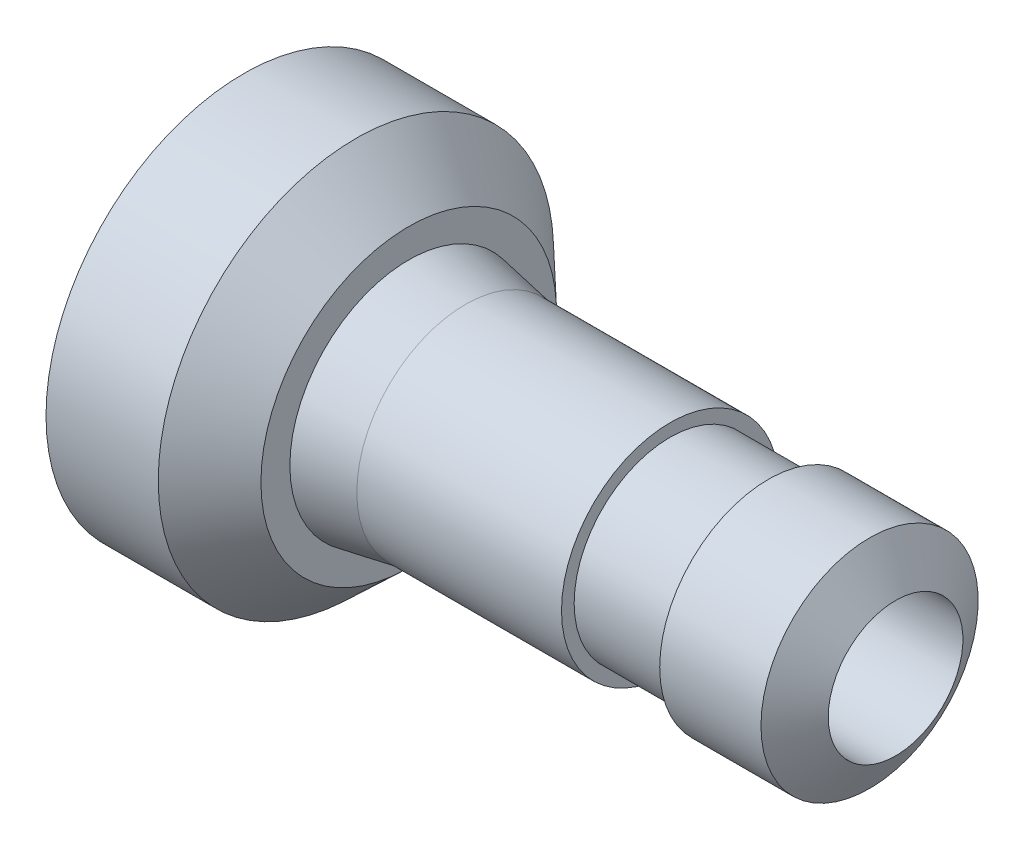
ISO-10303-21;
HEADER;
FILE_DESCRIPTION(('STEP AP214'),'2;1');
FILE_NAME('part.step','',(''),(''),'','','');
FILE_SCHEMA(('AUTOMOTIVE_DESIGN { 1 0 10303 214 1 1 1 1 }'));
ENDSEC;
DATA;
#1=APPLICATION_CONTEXT('core data for automotive mechanical design processes');
#2=APPLICATION_PROTOCOL_DEFINITION('international standard','automotive_design',2000,#1);
#3=PRODUCT_CONTEXT('',#1,'mechanical');
#4=PRODUCT('Part','Part','',(#3));
#5=PRODUCT_RELATED_PRODUCT_CATEGORY('part','',(#4));
#6=PRODUCT_DEFINITION_FORMATION('','',#4);
#7=PRODUCT_DEFINITION_CONTEXT('part definition',#1,'design');
#8=PRODUCT_DEFINITION('design','',#6,#7);
#9=PRODUCT_DEFINITION_SHAPE('','',#8);
#10=(LENGTH_UNIT() NAMED_UNIT(*) SI_UNIT(.MILLI.,.METRE.));
#11=(NAMED_UNIT(*) PLANE_ANGLE_UNIT() SI_UNIT($,.RADIAN.));
#12=(NAMED_UNIT(*) SI_UNIT($,.STERADIAN.) SOLID_ANGLE_UNIT());
#13=UNCERTAINTY_MEASURE_WITH_UNIT(LENGTH_MEASURE(1.E-05),#10,'distance_accuracy_value','');
#14=(GEOMETRIC_REPRESENTATION_CONTEXT(3) GLOBAL_UNCERTAINTY_ASSIGNED_CONTEXT((#13)) GLOBAL_UNIT_ASSIGNED_CONTEXT((#10,
#11,#12)) REPRESENTATION_CONTEXT('',''));
#15=CARTESIAN_POINT('',(0.,0.,0.));
#16=DIRECTION('',(0.,0.,1.));
#17=DIRECTION('',(1.,0.,0.));
#18=AXIS2_PLACEMENT_3D('',#15,#16,#17);
#19=CARTESIAN_POINT('',(234.50123622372,0.,0.));
#20=DIRECTION('',(-1.,0.,0.));
#21=DIRECTION('',(0.,0.,1.));
#22=AXIS2_PLACEMENT_3D('',#19,#20,#21);
#23=CONICAL_SURFACE('',#22,24.2189825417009,1.0085967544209);
#24=CARTESIAN_POINT('',(225.147772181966,0.,0.));
#25=DIRECTION('',(-1.,0.,0.));
#26=DIRECTION('',(0.,0.,1.));
#27=AXIS2_PLACEMENT_3D('',#24,#25,#26);
#28=CIRCLE('',#27,39.0653285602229);
#29=CARTESIAN_POINT('',(225.147772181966,0.,39.0653285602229));
#30=VERTEX_POINT('',#29);
#31=EDGE_CURVE('E10',#30,#30,#28,.T.);
#32=ORIENTED_EDGE('',*,*,#31,.F.);
#33=EDGE_LOOP('',(#32));
#34=FACE_BOUND('',#33,.T.);
#35=CARTESIAN_POINT('',(234.50123622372,0.,0.));
#36=DIRECTION('',(-1.,0.,0.));
#37=DIRECTION('',(0.,0.,1.));
#38=AXIS2_PLACEMENT_3D('',#35,#36,#37);
#39=CIRCLE('',#38,24.2189825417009);
#40=CARTESIAN_POINT('',(234.50123622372,0.,24.2189825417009));
#41=VERTEX_POINT('',#40);
#42=EDGE_CURVE('E77',#41,#41,#39,.T.);
#43=ORIENTED_EDGE('',*,*,#42,.T.);
#44=EDGE_LOOP('',(#43));
#45=FACE_BOUND('',#44,.T.);
#46=ADVANCED_FACE('F37',(#34,#45),#23,.T.);
#47=CARTESIAN_POINT('',(0.,0.,0.));
#48=DIRECTION('',(-1.,0.,0.));
#49=DIRECTION('',(0.,0.,1.));
#50=AXIS2_PLACEMENT_3D('',#47,#48,#49);
#51=CYLINDRICAL_SURFACE('',#50,39.0653285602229);
#52=CARTESIAN_POINT('',(188.724473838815,0.,0.));
#53=DIRECTION('',(-1.,0.,0.));
#54=DIRECTION('',(0.,0.,1.));
#55=AXIS2_PLACEMENT_3D('',#52,#53,#54);
#56=CIRCLE('',#55,39.0653285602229);
#57=CARTESIAN_POINT('',(188.724473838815,0.,39.0653285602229));
#58=VERTEX_POINT('',#57);
#59=EDGE_CURVE('E44',#58,#58,#56,.T.);
#60=ORIENTED_EDGE('',*,*,#59,.F.);
#61=EDGE_LOOP('',(#60));
#62=FACE_BOUND('',#61,.T.);
#63=ORIENTED_EDGE('',*,*,#31,.T.);
#64=EDGE_LOOP('',(#63));
#65=FACE_BOUND('',#64,.T.);
#66=ADVANCED_FACE('F97',(#62,#65),#51,.T.);
#67=CARTESIAN_POINT('',(188.724473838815,34.5153330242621,0.));
#68=DIRECTION('',(1.,0.,0.));
#69=DIRECTION('',(0.,0.,-1.));
#70=AXIS2_PLACEMENT_3D('',#67,#68,#69);
#71=PLANE('',#70);
#72=CARTESIAN_POINT('',(188.724473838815,0.,0.));
#73=DIRECTION('',(-1.,0.,0.));
#74=DIRECTION('',(0.,0.,1.));
#75=AXIS2_PLACEMENT_3D('',#72,#73,#74);
#76=CIRCLE('',#75,34.5153330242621);
#77=CARTESIAN_POINT('',(188.724473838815,0.,34.5153330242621));
#78=VERTEX_POINT('',#77);
#79=EDGE_CURVE('E48',#78,#78,#76,.T.);
#80=ORIENTED_EDGE('',*,*,#79,.F.);
#81=EDGE_LOOP('',(#80));
#82=FACE_BOUND('',#81,.T.);
#83=ORIENTED_EDGE('',*,*,#59,.T.);
#84=EDGE_LOOP('',(#83));
#85=FACE_BOUND('',#84,.T.);
#86=ADVANCED_FACE('F102',(#82,#85),#71,.F.);
#87=CARTESIAN_POINT('',(0.,0.,0.));
#88=DIRECTION('',(-1.,0.,0.));
#89=DIRECTION('',(0.,0.,1.));
#90=AXIS2_PLACEMENT_3D('',#87,#88,#89);
#91=CYLINDRICAL_SURFACE('',#90,34.5153330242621);
#92=CARTESIAN_POINT('',(153.394127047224,0.,0.));
#93=DIRECTION('',(-1.,0.,0.));
#94=DIRECTION('',(0.,0.,1.));
#95=AXIS2_PLACEMENT_3D('',#92,#93,#94);
#96=CIRCLE('',#95,34.5153330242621);
#97=CARTESIAN_POINT('',(153.394127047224,0.,34.5153330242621));
#98=VERTEX_POINT('',#97);
#99=EDGE_CURVE('E53',#98,#98,#96,.T.);
#100=ORIENTED_EDGE('',*,*,#99,.F.);
#101=EDGE_LOOP('',(#100));
#102=FACE_BOUND('',#101,.T.);
#103=ORIENTED_EDGE('',*,*,#79,.T.);
#104=EDGE_LOOP('',(#103));
#105=FACE_BOUND('',#104,.T.);
#106=ADVANCED_FACE('F107',(#102,#105),#91,.T.);
#107=CARTESIAN_POINT('',(153.394127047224,39.0653285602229,0.));
#108=DIRECTION('',(-1.,0.,0.));
#109=DIRECTION('',(0.,0.,1.));
#110=AXIS2_PLACEMENT_3D('',#107,#108,#109);
#111=PLANE('',#110);
#112=CARTESIAN_POINT('',(153.394127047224,0.,0.));
#113=DIRECTION('',(-1.,0.,0.));
#114=DIRECTION('',(0.,0.,1.));
#115=AXIS2_PLACEMENT_3D('',#112,#113,#114);
#116=CIRCLE('',#115,39.0653285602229);
#117=CARTESIAN_POINT('',(153.394127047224,0.,39.0653285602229));
#118=VERTEX_POINT('',#117);
#119=EDGE_CURVE('E56',#118,#118,#116,.T.);
#120=ORIENTED_EDGE('',*,*,#119,.F.);
#121=EDGE_LOOP('',(#120));
#122=FACE_BOUND('',#121,.T.);
#123=ORIENTED_EDGE('',*,*,#99,.T.);
#124=EDGE_LOOP('',(#123));
#125=FACE_BOUND('',#124,.T.);
#126=ADVANCED_FACE('F114',(#122,#125),#111,.F.);
#127=CARTESIAN_POINT('',(0.,0.,0.));
#128=DIRECTION('',(-1.,0.,0.));
#129=DIRECTION('',(0.,0.,1.));
#130=AXIS2_PLACEMENT_3D('',#127,#128,#129);
#131=CYLINDRICAL_SURFACE('',#130,39.0653285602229);
#132=CARTESIAN_POINT('',(79.7563770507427,0.,0.));
#133=DIRECTION('',(-1.,0.,0.));
#134=DIRECTION('',(0.,0.,1.));
#135=AXIS2_PLACEMENT_3D('',#132,#133,#134);
#136=CIRCLE('',#135,39.0653285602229);
#137=CARTESIAN_POINT('',(79.7563770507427,0.,39.0653285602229));
#138=VERTEX_POINT('',#137);
#139=EDGE_CURVE('E59',#138,#138,#136,.T.);
#140=ORIENTED_EDGE('',*,*,#139,.F.);
#141=EDGE_LOOP('',(#140));
#142=FACE_BOUND('',#141,.T.);
#143=ORIENTED_EDGE('',*,*,#119,.T.);
#144=EDGE_LOOP('',(#143));
#145=FACE_BOUND('',#144,.T.);
#146=ADVANCED_FACE('F118',(#142,#145),#131,.T.);
#147=CARTESIAN_POINT('',(79.7563770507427,0.,0.));
#148=DIRECTION('',(-1.,0.,0.));
#149=DIRECTION('',(0.,0.,1.));
#150=AXIS2_PLACEMENT_3D('',#147,#148,#149);
#151=CONICAL_SURFACE('',#150,39.0653285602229,0.178494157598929);
#152=CARTESIAN_POINT('',(59.3664055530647,0.,0.));
#153=DIRECTION('',(-1.,0.,0.));
#154=DIRECTION('',(0.,0.,1.));
#155=AXIS2_PLACEMENT_3D('',#152,#153,#154);
#156=CIRCLE('',#155,42.7439699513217);
#157=CARTESIAN_POINT('',(59.3664055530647,0.,42.7439699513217));
#158=VERTEX_POINT('',#157);
#159=EDGE_CURVE('E62',#158,#158,#156,.T.);
#160=ORIENTED_EDGE('',*,*,#159,.F.);
#161=EDGE_LOOP('',(#160));
#162=FACE_BOUND('',#161,.T.);
#163=ORIENTED_EDGE('',*,*,#139,.T.);
#164=EDGE_LOOP('',(#163));
#165=FACE_BOUND('',#164,.T.);
#166=ADVANCED_FACE('F122',(#162,#165),#151,.T.);
#167=CARTESIAN_POINT('',(59.3664055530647,53.1537943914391,0.));
#168=DIRECTION('',(-1.,0.,0.));
#169=DIRECTION('',(0.,0.,1.));
#170=AXIS2_PLACEMENT_3D('',#167,#168,#169);
#171=PLANE('',#170);
#172=CARTESIAN_POINT('',(59.3664055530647,0.,0.));
#173=DIRECTION('',(-1.,0.,0.));
#174=DIRECTION('',(0.,0.,1.));
#175=AXIS2_PLACEMENT_3D('',#172,#173,#174);
#176=CIRCLE('',#175,53.1537943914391);
#177=CARTESIAN_POINT('',(59.3664055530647,0.,53.1537943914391));
#178=VERTEX_POINT('',#177);
#179=EDGE_CURVE('E65',#178,#178,#176,.T.);
#180=ORIENTED_EDGE('',*,*,#179,.F.);
#181=EDGE_LOOP('',(#180));
#182=FACE_BOUND('',#181,.T.);
#183=ORIENTED_EDGE('',*,*,#159,.T.);
#184=EDGE_LOOP('',(#183));
#185=FACE_BOUND('',#184,.T.);
#186=ADVANCED_FACE('F126',(#182,#185),#171,.F.);
#187=CARTESIAN_POINT('',(59.3664055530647,0.,0.));
#188=DIRECTION('',(-1.,0.,0.));
#189=DIRECTION('',(0.,0.,1.));
#190=AXIS2_PLACEMENT_3D('',#187,#188,#189);
#191=CONICAL_SURFACE('',#190,53.1537943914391,0.757368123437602);
#192=CARTESIAN_POINT('',(40.3829723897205,0.,0.));
#193=DIRECTION('',(-1.,0.,0.));
#194=DIRECTION('',(0.,0.,1.));
#195=AXIS2_PLACEMENT_3D('',#192,#193,#194);
#196=CIRCLE('',#195,71.1017675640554);
#197=CARTESIAN_POINT('',(40.3829723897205,0.,71.1017675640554));
#198=VERTEX_POINT('',#197);
#199=EDGE_CURVE('E68',#198,#198,#196,.T.);
#200=ORIENTED_EDGE('',*,*,#199,.F.);
#201=EDGE_LOOP('',(#200));
#202=FACE_BOUND('',#201,.T.);
#203=ORIENTED_EDGE('',*,*,#179,.T.);
#204=EDGE_LOOP('',(#203));
#205=FACE_BOUND('',#204,.T.);
#206=ADVANCED_FACE('F130',(#202,#205),#191,.T.);
#207=CARTESIAN_POINT('',(0.,0.,0.));
#208=DIRECTION('',(-1.,0.,0.));
#209=DIRECTION('',(0.,0.,1.));
#210=AXIS2_PLACEMENT_3D('',#207,#208,#209);
#211=CYLINDRICAL_SURFACE('',#210,71.1017675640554);
#212=CARTESIAN_POINT('',(0.,0.,0.));
#213=DIRECTION('',(-1.,0.,0.));
#214=DIRECTION('',(0.,0.,1.));
#215=AXIS2_PLACEMENT_3D('',#212,#213,#214);
#216=CIRCLE('',#215,71.1017675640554);
#217=CARTESIAN_POINT('',(0.,0.,71.1017675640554));
#218=VERTEX_POINT('',#217);
#219=EDGE_CURVE('E71',#218,#218,#216,.T.);
#220=ORIENTED_EDGE('',*,*,#219,.F.);
#221=EDGE_LOOP('',(#220));
#222=FACE_BOUND('',#221,.T.);
#223=ORIENTED_EDGE('',*,*,#199,.T.);
#224=EDGE_LOOP('',(#223));
#225=FACE_BOUND('',#224,.T.);
#226=ADVANCED_FACE('F134',(#222,#225),#211,.T.);
#227=CARTESIAN_POINT('',(0.,53.1536128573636,0.));
#228=DIRECTION('',(1.,0.,0.));
#229=DIRECTION('',(0.,0.,-1.));
#230=AXIS2_PLACEMENT_3D('',#227,#228,#229);
#231=PLANE('',#230);
#232=CARTESIAN_POINT('',(0.,0.,0.));
#233=DIRECTION('',(-1.,0.,0.));
#234=DIRECTION('',(0.,0.,1.));
#235=AXIS2_PLACEMENT_3D('',#232,#233,#234);
#236=CIRCLE('',#235,53.1536128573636);
#237=CARTESIAN_POINT('',(0.,0.,53.1536128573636));
#238=VERTEX_POINT('',#237);
#239=EDGE_CURVE('E74',#238,#238,#236,.T.);
#240=ORIENTED_EDGE('',*,*,#239,.F.);
#241=EDGE_LOOP('',(#240));
#242=FACE_BOUND('',#241,.T.);
#243=ORIENTED_EDGE('',*,*,#219,.T.);
#244=EDGE_LOOP('',(#243));
#245=FACE_BOUND('',#244,.T.);
#246=ADVANCED_FACE('F94',(#242,#245),#231,.F.);
#247=CARTESIAN_POINT('',(0.,0.,0.));
#248=DIRECTION('',(-1.,0.,0.));
#249=DIRECTION('',(0.,0.,1.));
#250=AXIS2_PLACEMENT_3D('',#247,#248,#249);
#251=TOROIDAL_SURFACE('',#250,34.5153330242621,18.6382798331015);
#252=CARTESIAN_POINT('',(15.5361076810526,0.,0.));
#253=DIRECTION('',(-1.,0.,0.));
#254=DIRECTION('',(0.,0.,1.));
#255=AXIS2_PLACEMENT_3D('',#252,#253,#254);
#256=CIRCLE('',#255,24.2189825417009);
#257=CARTESIAN_POINT('',(15.5361076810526,0.,24.2189825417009));
#258=VERTEX_POINT('',#257);
#259=EDGE_CURVE('E40',#258,#258,#256,.F.);
#260=ORIENTED_EDGE('',*,*,#259,.T.);
#261=EDGE_LOOP('',(#260));
#262=FACE_BOUND('',#261,.T.);
#263=ORIENTED_EDGE('',*,*,#239,.T.);
#264=EDGE_LOOP('',(#263));
#265=FACE_BOUND('',#264,.T.);
#266=ADVANCED_FACE('F84',(#262,#265),#251,.F.);
#267=CARTESIAN_POINT('',(0.,0.,0.));
#268=DIRECTION('',(1.,0.,0.));
#269=DIRECTION('',(0.,0.,-1.));
#270=AXIS2_PLACEMENT_3D('',#267,#268,#269);
#271=CYLINDRICAL_SURFACE('',#270,24.2189825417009);
#272=ORIENTED_EDGE('',*,*,#259,.F.);
#273=EDGE_LOOP('',(#272));
#274=FACE_BOUND('',#273,.T.);
#275=ORIENTED_EDGE('',*,*,#42,.F.);
#276=EDGE_LOOP('',(#275));
#277=FACE_BOUND('',#276,.T.);
#278=ADVANCED_FACE('F87',(#274,#277),#271,.F.);
#279=CLOSED_SHELL('',(#46,#66,#86,#106,#126,#146,#166,#186,#206,#226,#246,#266,#278));
#280=MANIFOLD_SOLID_BREP('B2',#279);
#281=ADVANCED_BREP_SHAPE_REPRESENTATION('',(#18,#280),#14);
#282=SHAPE_DEFINITION_REPRESENTATION(#9,#281);
ENDSEC;
END-ISO-10303-21;
